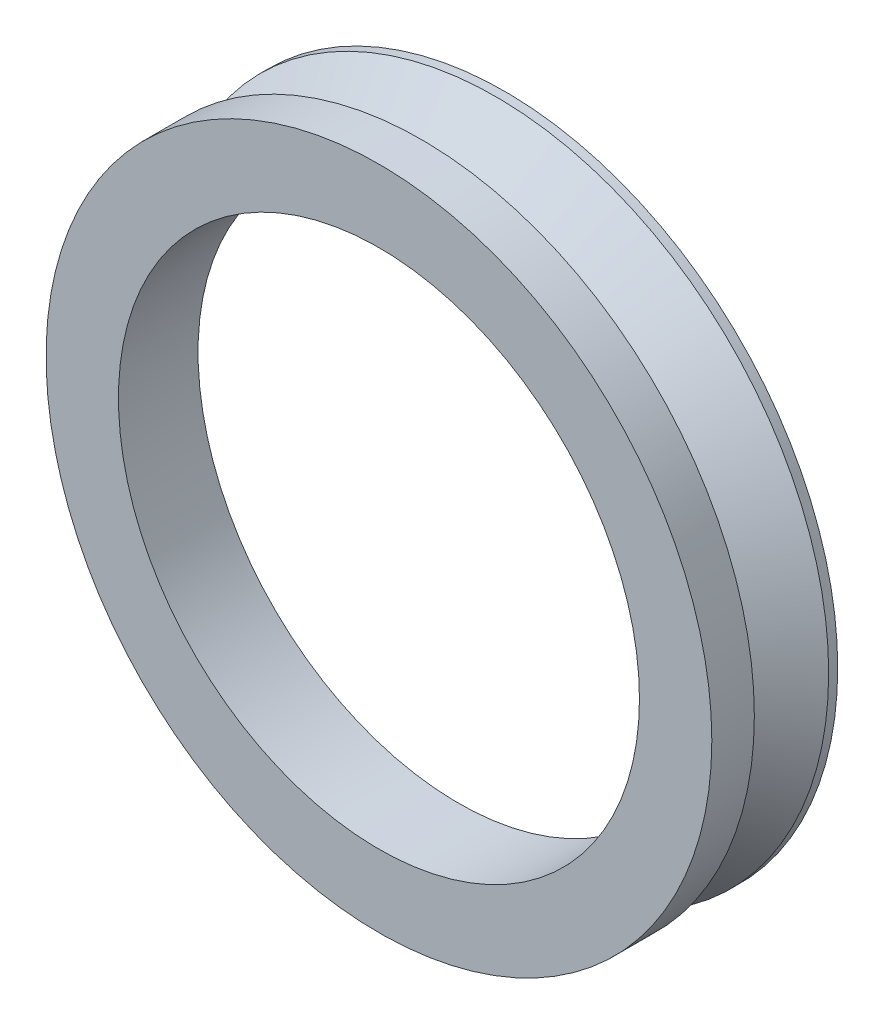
ISO-10303-21;
HEADER;
FILE_DESCRIPTION(('STEP AP214'),'2;1');
FILE_NAME('part.step','',(''),(''),'','','');
FILE_SCHEMA(('AUTOMOTIVE_DESIGN { 1 0 10303 214 1 1 1 1 }'));
ENDSEC;
DATA;
#1=APPLICATION_CONTEXT('core data for automotive mechanical design processes');
#2=APPLICATION_PROTOCOL_DEFINITION('international standard','automotive_design',2000,#1);
#3=PRODUCT_CONTEXT('',#1,'mechanical');
#4=PRODUCT('Part','Part','',(#3));
#5=PRODUCT_RELATED_PRODUCT_CATEGORY('part','',(#4));
#6=PRODUCT_DEFINITION_FORMATION('','',#4);
#7=PRODUCT_DEFINITION_CONTEXT('part definition',#1,'design');
#8=PRODUCT_DEFINITION('design','',#6,#7);
#9=PRODUCT_DEFINITION_SHAPE('','',#8);
#10=(LENGTH_UNIT() NAMED_UNIT(*) SI_UNIT(.MILLI.,.METRE.));
#11=(NAMED_UNIT(*) PLANE_ANGLE_UNIT() SI_UNIT($,.RADIAN.));
#12=(NAMED_UNIT(*) SI_UNIT($,.STERADIAN.) SOLID_ANGLE_UNIT());
#13=UNCERTAINTY_MEASURE_WITH_UNIT(LENGTH_MEASURE(1.E-05),#10,'distance_accuracy_value','');
#14=(GEOMETRIC_REPRESENTATION_CONTEXT(3) GLOBAL_UNCERTAINTY_ASSIGNED_CONTEXT((#13)) GLOBAL_UNIT_ASSIGNED_CONTEXT((#10,
#11,#12)) REPRESENTATION_CONTEXT('',''));
#15=CARTESIAN_POINT('',(0.,0.,0.));
#16=DIRECTION('',(0.,0.,1.));
#17=DIRECTION('',(1.,0.,0.));
#18=AXIS2_PLACEMENT_3D('',#15,#16,#17);
#19=CARTESIAN_POINT('',(0.,23.,0.));
#20=DIRECTION('',(0.,0.,-1.));
#21=DIRECTION('',(-1.,0.,0.));
#22=AXIS2_PLACEMENT_3D('',#19,#20,#21);
#23=PLANE('',#22);
#24=CARTESIAN_POINT('',(0.,0.,0.));
#25=DIRECTION('',(0.,0.,1.));
#26=DIRECTION('',(1.,0.,0.));
#27=AXIS2_PLACEMENT_3D('',#24,#25,#26);
#28=CIRCLE('',#27,18.);
#29=CARTESIAN_POINT('',(18.,0.,0.));
#30=VERTEX_POINT('',#29);
#31=EDGE_CURVE('E10',#30,#30,#28,.T.);
#32=ORIENTED_EDGE('',*,*,#31,.F.);
#33=EDGE_LOOP('',(#32));
#34=FACE_BOUND('',#33,.T.);
#35=CARTESIAN_POINT('',(0.,0.,0.));
#36=DIRECTION('',(0.,0.,1.));
#37=DIRECTION('',(1.,0.,0.));
#38=AXIS2_PLACEMENT_3D('',#35,#36,#37);
#39=CIRCLE('',#38,23.);
#40=CARTESIAN_POINT('',(23.,0.,0.));
#41=VERTEX_POINT('',#40);
#42=EDGE_CURVE('E53',#41,#41,#39,.T.);
#43=ORIENTED_EDGE('',*,*,#42,.T.);
#44=EDGE_LOOP('',(#43));
#45=FACE_BOUND('',#44,.T.);
#46=ADVANCED_FACE('F28',(#34,#45),#23,.F.);
#47=CARTESIAN_POINT('',(0.,0.,0.));
#48=DIRECTION('',(0.,0.,1.));
#49=DIRECTION('',(1.,0.,0.));
#50=AXIS2_PLACEMENT_3D('',#47,#48,#49);
#51=CYLINDRICAL_SURFACE('',#50,18.);
#52=CARTESIAN_POINT('',(0.,0.,-5.5));
#53=DIRECTION('',(0.,0.,1.));
#54=DIRECTION('',(1.,0.,0.));
#55=AXIS2_PLACEMENT_3D('',#52,#53,#54);
#56=CIRCLE('',#55,18.);
#57=CARTESIAN_POINT('',(18.,0.,-5.5));
#58=VERTEX_POINT('',#57);
#59=EDGE_CURVE('E34',#58,#58,#56,.T.);
#60=ORIENTED_EDGE('',*,*,#59,.F.);
#61=EDGE_LOOP('',(#60));
#62=FACE_BOUND('',#61,.T.);
#63=ORIENTED_EDGE('',*,*,#31,.T.);
#64=EDGE_LOOP('',(#63));
#65=FACE_BOUND('',#64,.T.);
#66=ADVANCED_FACE('F84',(#62,#65),#51,.F.);
#67=CARTESIAN_POINT('',(0.,0.,-5.5));
#68=DIRECTION('',(0.,0.,-1.));
#69=DIRECTION('',(-1.,0.,0.));
#70=AXIS2_PLACEMENT_3D('',#67,#68,#69);
#71=CONICAL_SURFACE('',#70,18.,1.00148313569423);
#72=CARTESIAN_POINT('',(0.,0.,-8.7));
#73=DIRECTION('',(0.,0.,1.));
#74=DIRECTION('',(1.,0.,0.));
#75=AXIS2_PLACEMENT_3D('',#72,#73,#74);
#76=CIRCLE('',#75,23.);
#77=CARTESIAN_POINT('',(23.,0.,-8.7));
#78=VERTEX_POINT('',#77);
#79=EDGE_CURVE('E38',#78,#78,#76,.T.);
#80=ORIENTED_EDGE('',*,*,#79,.F.);
#81=EDGE_LOOP('',(#80));
#82=FACE_BOUND('',#81,.T.);
#83=ORIENTED_EDGE('',*,*,#59,.T.);
#84=EDGE_LOOP('',(#83));
#85=FACE_BOUND('',#84,.T.);
#86=ADVANCED_FACE('F79',(#82,#85),#71,.F.);
#87=CARTESIAN_POINT('',(0.,0.,0.));
#88=DIRECTION('',(0.,0.,1.));
#89=DIRECTION('',(1.,0.,0.));
#90=AXIS2_PLACEMENT_3D('',#87,#88,#89);
#91=CYLINDRICAL_SURFACE('',#90,23.);
#92=CARTESIAN_POINT('',(0.,0.,-8.075));
#93=DIRECTION('',(0.,0.,1.));
#94=DIRECTION('',(1.,0.,0.));
#95=AXIS2_PLACEMENT_3D('',#92,#93,#94);
#96=CIRCLE('',#95,23.);
#97=CARTESIAN_POINT('',(23.,0.,-8.075));
#98=VERTEX_POINT('',#97);
#99=EDGE_CURVE('E42',#98,#98,#96,.T.);
#100=ORIENTED_EDGE('',*,*,#99,.F.);
#101=EDGE_LOOP('',(#100));
#102=FACE_BOUND('',#101,.T.);
#103=ORIENTED_EDGE('',*,*,#79,.T.);
#104=EDGE_LOOP('',(#103));
#105=FACE_BOUND('',#104,.T.);
#106=ADVANCED_FACE('F73',(#102,#105),#91,.T.);
#107=CARTESIAN_POINT('',(0.,0.,-8.075));
#108=DIRECTION('',(0.,0.,-1.));
#109=DIRECTION('',(-1.,0.,0.));
#110=AXIS2_PLACEMENT_3D('',#107,#108,#109);
#111=CONICAL_SURFACE('',#110,23.,0.826950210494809);
#112=CARTESIAN_POINT('',(0.,0.,-4.39433131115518));
#113=DIRECTION('',(0.,0.,1.));
#114=DIRECTION('',(1.,0.,0.));
#115=AXIS2_PLACEMENT_3D('',#112,#113,#114);
#116=CIRCLE('',#115,19.);
#117=CARTESIAN_POINT('',(19.,0.,-4.39433131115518));
#118=VERTEX_POINT('',#117);
#119=EDGE_CURVE('E47',#118,#118,#116,.T.);
#120=ORIENTED_EDGE('',*,*,#119,.F.);
#121=EDGE_LOOP('',(#120));
#122=FACE_BOUND('',#121,.T.);
#123=ORIENTED_EDGE('',*,*,#99,.T.);
#124=EDGE_LOOP('',(#123));
#125=FACE_BOUND('',#124,.T.);
#126=ADVANCED_FACE('F67',(#122,#125),#111,.T.);
#127=CARTESIAN_POINT('',(0.,0.,-4.39433131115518));
#128=DIRECTION('',(0.,0.,1.));
#129=DIRECTION('',(1.,0.,0.));
#130=AXIS2_PLACEMENT_3D('',#127,#128,#129);
#131=CONICAL_SURFACE('',#130,19.,1.22173047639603);
#132=CARTESIAN_POINT('',(0.,0.,-2.93845037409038));
#133=DIRECTION('',(0.,0.,1.));
#134=DIRECTION('',(1.,0.,0.));
#135=AXIS2_PLACEMENT_3D('',#132,#133,#134);
#136=CIRCLE('',#135,23.);
#137=CARTESIAN_POINT('',(23.,0.,-2.93845037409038));
#138=VERTEX_POINT('',#137);
#139=EDGE_CURVE('E50',#138,#138,#136,.T.);
#140=ORIENTED_EDGE('',*,*,#139,.F.);
#141=EDGE_LOOP('',(#140));
#142=FACE_BOUND('',#141,.T.);
#143=ORIENTED_EDGE('',*,*,#119,.T.);
#144=EDGE_LOOP('',(#143));
#145=FACE_BOUND('',#144,.T.);
#146=ADVANCED_FACE('F61',(#142,#145),#131,.T.);
#147=CARTESIAN_POINT('',(0.,0.,0.));
#148=DIRECTION('',(0.,0.,1.));
#149=DIRECTION('',(1.,0.,0.));
#150=AXIS2_PLACEMENT_3D('',#147,#148,#149);
#151=CYLINDRICAL_SURFACE('',#150,23.);
#152=ORIENTED_EDGE('',*,*,#42,.F.);
#153=EDGE_LOOP('',(#152));
#154=FACE_BOUND('',#153,.T.);
#155=ORIENTED_EDGE('',*,*,#139,.T.);
#156=EDGE_LOOP('',(#155));
#157=FACE_BOUND('',#156,.T.);
#158=ADVANCED_FACE('F58',(#154,#157),#151,.T.);
#159=CLOSED_SHELL('',(#46,#66,#86,#106,#126,#146,#158));
#160=MANIFOLD_SOLID_BREP('B2',#159);
#161=ADVANCED_BREP_SHAPE_REPRESENTATION('',(#18,#160),#14);
#162=SHAPE_DEFINITION_REPRESENTATION(#9,#161);
ENDSEC;
END-ISO-10303-21;
